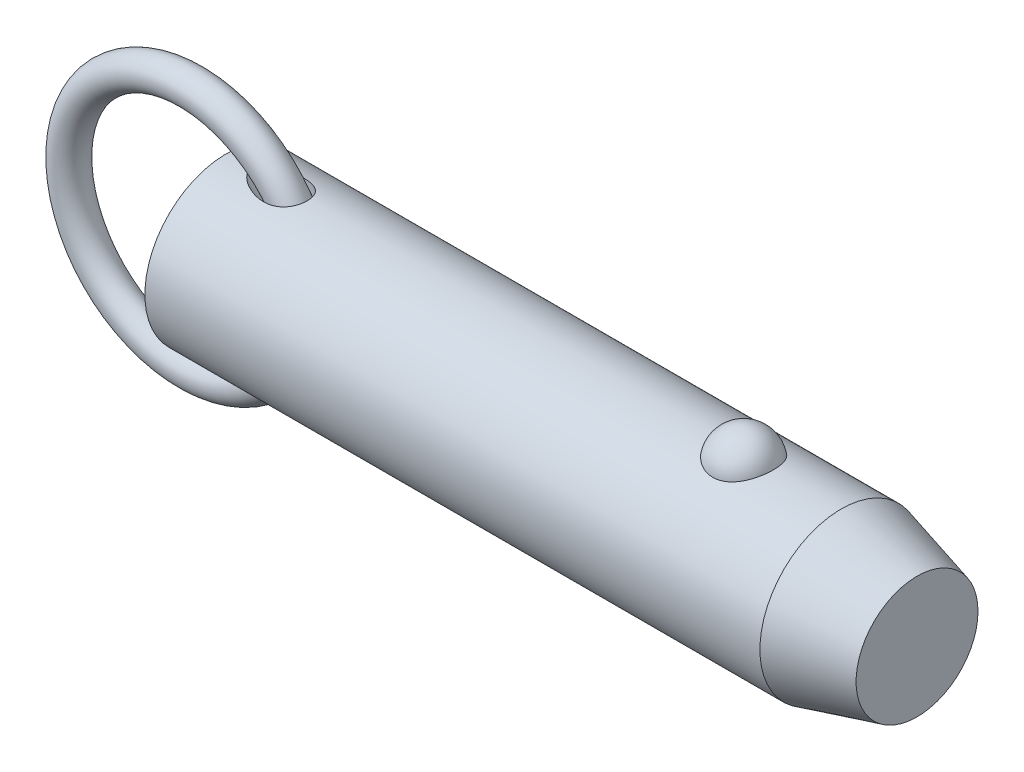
ISO-10303-21;
HEADER;
FILE_DESCRIPTION(('STEP AP214'),'2;1');
FILE_NAME('part.step','',(''),(''),'','','');
FILE_SCHEMA(('AUTOMOTIVE_DESIGN { 1 0 10303 214 1 1 1 1 }'));
ENDSEC;
DATA;
#1=APPLICATION_CONTEXT('core data for automotive mechanical design processes');
#2=APPLICATION_PROTOCOL_DEFINITION('international standard','automotive_design',2000,#1);
#3=PRODUCT_CONTEXT('',#1,'mechanical');
#4=PRODUCT('Part','Part','',(#3));
#5=PRODUCT_RELATED_PRODUCT_CATEGORY('part','',(#4));
#6=PRODUCT_DEFINITION_FORMATION('','',#4);
#7=PRODUCT_DEFINITION_CONTEXT('part definition',#1,'design');
#8=PRODUCT_DEFINITION('design','',#6,#7);
#9=PRODUCT_DEFINITION_SHAPE('','',#8);
#10=(LENGTH_UNIT() NAMED_UNIT(*) SI_UNIT(.MILLI.,.METRE.));
#11=(NAMED_UNIT(*) PLANE_ANGLE_UNIT() SI_UNIT($,.RADIAN.));
#12=(NAMED_UNIT(*) SI_UNIT($,.STERADIAN.) SOLID_ANGLE_UNIT());
#13=UNCERTAINTY_MEASURE_WITH_UNIT(LENGTH_MEASURE(1.E-05),#10,'distance_accuracy_value','');
#14=(GEOMETRIC_REPRESENTATION_CONTEXT(3) GLOBAL_UNCERTAINTY_ASSIGNED_CONTEXT((#13)) GLOBAL_UNIT_ASSIGNED_CONTEXT((#10,
#11,#12)) REPRESENTATION_CONTEXT('',''));
#15=CARTESIAN_POINT('',(0.,0.,0.));
#16=DIRECTION('',(0.,0.,1.));
#17=DIRECTION('',(1.,0.,0.));
#18=AXIS2_PLACEMENT_3D('',#15,#16,#17);
#19=CARTESIAN_POINT('',(-5.53898640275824,0.,0.));
#20=DIRECTION('',(0.,0.,1.));
#21=DIRECTION('',(1.,0.,0.));
#22=AXIS2_PLACEMENT_3D('',#19,#20,#21);
#23=TOROIDAL_SURFACE('',#22,19.05,2.54);
#24=CARTESIAN_POINT('',(16.0510135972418,0.,0.));
#25=VERTEX_POINT('',#24);
#26=VERTEX_LOOP('',#25);
#27=FACE_BOUND('',#26,.T.);
#28=ADVANCED_FACE('P0_F12',(#27),#23,.T.);
#29=CLOSED_SHELL('',(#28));
#30=MANIFOLD_SOLID_BREP('P0_B1',#29);
#31=CARTESIAN_POINT('',(0.,0.,0.));
#32=DIRECTION('',(1.,0.,0.));
#33=DIRECTION('',(0.,0.,-1.));
#34=AXIS2_PLACEMENT_3D('',#31,#32,#33);
#35=CYLINDRICAL_SURFACE('',#34,12.7);
#36=CARTESIAN_POINT('',(96.1007386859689,0.,0.));
#37=DIRECTION('',(1.,0.,0.));
#38=DIRECTION('',(0.,0.,-1.));
#39=AXIS2_PLACEMENT_3D('',#36,#37,#38);
#40=CIRCLE('',#39,12.7);
#41=CARTESIAN_POINT('',(96.1007386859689,0.,-12.7));
#42=VERTEX_POINT('',#41);
#43=EDGE_CURVE('P1_E89',#42,#42,#40,.T.);
#44=ORIENTED_EDGE('',*,*,#43,.F.);
#45=EDGE_LOOP('',(#44));
#46=FACE_BOUND('',#45,.T.);
#47=CARTESIAN_POINT('',(0.,0.,0.));
#48=DIRECTION('',(1.,0.,0.));
#49=DIRECTION('',(0.,0.,-1.));
#50=AXIS2_PLACEMENT_3D('',#47,#48,#49);
#51=CIRCLE('',#50,12.7);
#52=CARTESIAN_POINT('',(0.,0.,-12.7));
#53=VERTEX_POINT('',#52);
#54=EDGE_CURVE('P1_E52',#53,#53,#51,.T.);
#55=ORIENTED_EDGE('',*,*,#54,.T.);
#56=EDGE_LOOP('',(#55));
#57=FACE_BOUND('',#56,.T.);
#58=CARTESIAN_POINT('',(80.8600429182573,11.7500437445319,4.81938502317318));
#59=CARTESIAN_POINT('',(80.735088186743,11.7500430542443,4.81938571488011));
#60=CARTESIAN_POINT('',(80.610144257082,11.7520975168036,4.81438658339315));
#61=CARTESIAN_POINT('',(80.3611425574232,11.760253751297,4.79442904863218));
#62=CARTESIAN_POINT('',(80.2370850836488,11.7663568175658,4.77946746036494));
#63=CARTESIAN_POINT('',(79.9909016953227,11.7824262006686,4.7397141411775));
#64=CARTESIAN_POINT('',(79.8687744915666,11.7923898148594,4.71492928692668));
#65=CARTESIAN_POINT('',(79.6271874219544,11.8158938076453,4.65571340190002));
#66=CARTESIAN_POINT('',(79.5077285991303,11.8294355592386,4.6212786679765));
#67=CARTESIAN_POINT('',(79.2725578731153,11.8596812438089,4.54309502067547));
#68=CARTESIAN_POINT('',(79.1568393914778,11.8763792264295,4.49936361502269));
#69=CARTESIAN_POINT('',(78.9296530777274,11.9124878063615,4.40287235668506));
#70=CARTESIAN_POINT('',(78.8181868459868,11.9318994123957,4.35010914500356));
#71=CARTESIAN_POINT('',(78.4912782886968,11.9934256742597,4.17881316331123));
#72=CARTESIAN_POINT('',(78.2831270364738,12.038858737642,4.04720756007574));
#73=CARTESIAN_POINT('',(77.8858509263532,12.1352173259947,3.748564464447));
#74=CARTESIAN_POINT('',(77.6974438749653,12.1862630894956,3.58061821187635));
#75=CARTESIAN_POINT('',(77.3505213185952,12.2875163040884,3.21600758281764));
#76=CARTESIAN_POINT('',(77.1920113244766,12.3377235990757,3.0193379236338));
#77=CARTESIAN_POINT('',(76.9016887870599,12.434492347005,2.592916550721));
#78=CARTESIAN_POINT('',(76.7713762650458,12.4807925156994,2.36208286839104));
#79=CARTESIAN_POINT('',(76.5494079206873,12.5623454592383,1.88070399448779));
#80=CARTESIAN_POINT('',(76.4577554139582,12.5975972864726,1.63015711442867));
#81=CARTESIAN_POINT('',(76.3140466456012,12.6538414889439,1.1129886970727));
#82=CARTESIAN_POINT('',(76.2624990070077,12.6746503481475,0.846205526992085));
#83=CARTESIAN_POINT('',(76.2019771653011,12.699153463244,0.307085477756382));
#84=CARTESIAN_POINT('',(76.1930018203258,12.7028481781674,0.0347487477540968));
#85=CARTESIAN_POINT('',(76.2177310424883,12.6927785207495,-0.506073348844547));
#86=CARTESIAN_POINT('',(76.2511899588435,12.6791146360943,-0.774571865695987));
#87=CARTESIAN_POINT('',(76.3596877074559,12.635882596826,-1.30170246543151));
#88=CARTESIAN_POINT('',(76.4347272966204,12.606314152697,-1.5603343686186));
#89=CARTESIAN_POINT('',(76.6250000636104,12.5342328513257,-2.06083899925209));
#90=CARTESIAN_POINT('',(76.7402872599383,12.4917026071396,-2.3026886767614));
#91=CARTESIAN_POINT('',(77.0087044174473,12.3981123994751,-2.76259600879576));
#92=CARTESIAN_POINT('',(77.1618374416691,12.3470517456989,-2.98065173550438));
#93=CARTESIAN_POINT('',(77.5035077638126,12.2416045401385,-3.38786328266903));
#94=CARTESIAN_POINT('',(77.6922017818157,12.1872040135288,-3.57688418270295));
#95=CARTESIAN_POINT('',(78.1002392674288,12.0814086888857,-3.91941073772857));
#96=CARTESIAN_POINT('',(78.3195800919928,12.0300136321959,-4.07291945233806));
#97=CARTESIAN_POINT('',(78.778375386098,11.9373542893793,-4.33691289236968));
#98=CARTESIAN_POINT('',(79.0173044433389,11.8958982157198,-4.44824125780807));
#99=CARTESIAN_POINT('',(79.5124376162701,11.8268116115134,-4.62881985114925));
#100=CARTESIAN_POINT('',(79.7686351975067,11.7991758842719,-4.69808589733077));
#101=CARTESIAN_POINT('',(80.2771640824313,11.7622209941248,-4.78983181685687));
#102=CARTESIAN_POINT('',(80.5290414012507,11.7520502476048,-4.81449025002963));
#103=CARTESIAN_POINT('',(81.0335734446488,11.7485796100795,-4.82295735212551));
#104=CARTESIAN_POINT('',(81.2862280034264,11.7552763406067,-4.80677420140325));
#105=CARTESIAN_POINT('',(81.7768341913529,11.7842584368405,-4.73525430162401));
#106=CARTESIAN_POINT('',(82.0149984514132,11.8060486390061,-4.68116061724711));
#107=CARTESIAN_POINT('',(82.4784894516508,11.8622750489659,-4.53678133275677));
#108=CARTESIAN_POINT('',(82.7038151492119,11.8967122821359,-4.44649279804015));
#109=CARTESIAN_POINT('',(83.1408018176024,11.9754603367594,-4.2298761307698));
#110=CARTESIAN_POINT('',(83.3520579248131,12.0199699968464,-4.10280539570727));
#111=CARTESIAN_POINT('',(83.7506012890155,12.1138028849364,-3.81685409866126));
#112=CARTESIAN_POINT('',(83.9378830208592,12.163127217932,-3.65796622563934));
#113=CARTESIAN_POINT('',(84.2933509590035,12.2642343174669,-3.30364864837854));
#114=CARTESIAN_POINT('',(84.4601119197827,12.3160165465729,-3.10678783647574));
#115=CARTESIAN_POINT('',(84.7595799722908,12.4142566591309,-2.68748409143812));
#116=CARTESIAN_POINT('',(84.8922809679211,12.4607135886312,-2.46503658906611));
#117=CARTESIAN_POINT('',(85.1246912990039,12.5450236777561,-1.99289519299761));
#118=CARTESIAN_POINT('',(85.223215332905,12.5825557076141,-1.7425591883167));
#119=CARTESIAN_POINT('',(85.3792277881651,12.6431720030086,-1.22773734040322));
#120=CARTESIAN_POINT('',(85.4367157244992,12.6662560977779,-0.963251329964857));
#121=CARTESIAN_POINT('',(85.5095441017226,12.6956486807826,-0.427355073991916));
#122=CARTESIAN_POINT('',(85.5248378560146,12.7019385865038,-0.155937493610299));
#123=CARTESIAN_POINT('',(85.5127794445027,12.6970201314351,0.385928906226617));
#124=CARTESIAN_POINT('',(85.4854280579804,12.6858120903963,0.656377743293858));
#125=CARTESIAN_POINT('',(85.4130609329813,12.6568455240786,1.05454017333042));
#126=CARTESIAN_POINT('',(85.3837963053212,12.6451962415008,1.18577850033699));
#127=CARTESIAN_POINT('',(85.3150228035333,12.6181819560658,1.4451380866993));
#128=CARTESIAN_POINT('',(85.2755176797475,12.6028183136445,1.57326046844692));
#129=CARTESIAN_POINT('',(85.1864397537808,12.5687547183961,1.82554978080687));
#130=CARTESIAN_POINT('',(85.1368627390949,12.5500533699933,1.9497150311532));
#131=CARTESIAN_POINT('',(85.0279211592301,12.5098093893,2.19314370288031));
#132=CARTESIAN_POINT('',(84.9685601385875,12.4882677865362,2.31240887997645));
#133=CARTESIAN_POINT('',(84.8399712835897,12.4427679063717,2.54593031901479));
#134=CARTESIAN_POINT('',(84.7706888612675,12.4187964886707,2.66015396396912));
#135=CARTESIAN_POINT('',(84.622903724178,12.3691892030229,2.88202659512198));
#136=CARTESIAN_POINT('',(84.5444044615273,12.3435539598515,2.98967802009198));
#137=CARTESIAN_POINT('',(84.3785502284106,12.2912955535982,3.19774385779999));
#138=CARTESIAN_POINT('',(84.2911918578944,12.2646720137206,3.29815546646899));
#139=CARTESIAN_POINT('',(84.1081617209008,12.2111945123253,3.49095035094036));
#140=CARTESIAN_POINT('',(84.0124932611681,12.1843406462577,3.58333679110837));
#141=CARTESIAN_POINT('',(83.8136272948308,12.1312249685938,3.75922876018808));
#142=CARTESIAN_POINT('',(83.7104503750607,12.104961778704,3.84275713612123));
#143=CARTESIAN_POINT('',(83.4970133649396,12.0537284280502,4.00056406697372));
#144=CARTESIAN_POINT('',(83.3867562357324,12.028757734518,4.07484645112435));
#145=CARTESIAN_POINT('',(83.1597550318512,11.9808306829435,4.21367959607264));
#146=CARTESIAN_POINT('',(83.0430068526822,11.9578756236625,4.27822410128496));
#147=CARTESIAN_POINT('',(82.8039425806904,11.9147184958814,4.39698483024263));
#148=CARTESIAN_POINT('',(82.6816287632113,11.894515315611,4.45120522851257));
#149=CARTESIAN_POINT('',(82.422952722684,11.8561129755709,4.55255353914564));
#150=CARTESIAN_POINT('',(82.2862237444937,11.8381764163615,4.59884858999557));
#151=CARTESIAN_POINT('',(82.0086087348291,11.8069093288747,4.67853897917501));
#152=CARTESIAN_POINT('',(81.8677245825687,11.7935767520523,4.71194005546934));
#153=CARTESIAN_POINT('',(81.5830944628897,11.7720277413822,4.76552188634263));
#154=CARTESIAN_POINT('',(81.4393488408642,11.7638106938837,4.78570422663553));
#155=CARTESIAN_POINT('',(81.1504114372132,11.7528195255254,4.81263433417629));
#156=CARTESIAN_POINT('',(81.0052198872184,11.7500445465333,4.81938421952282));
#157=CARTESIAN_POINT('',(80.8600429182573,11.7500437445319,4.81938502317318));
#158=B_SPLINE_CURVE_WITH_KNOTS('',3,(#58,#59,#60,#61,#62,#63,#64,#65,#66,#67,#68,#69,#70,#71,
#72,#73,#74,#75,#76,#77,#78,#79,#80,#81,#82,#83,#84,#85,#86,#87,#88,#89,#90,#91,#92,#93,#94,#95,
#96,#97,#98,#99,#100,#101,#102,#103,#104,#105,#106,#107,#108,#109,#110,#111,#112,#113,#114,#115,
#116,#117,#118,#119,#120,#121,#122,#123,#124,#125,#126,#127,#128,#129,#130,#131,#132,#133,#134,
#135,#136,#137,#138,#139,#140,#141,#142,#143,#144,#145,#146,#147,#148,#149,#150,#151,#152,#153,
#154,#155,#156,#157),.UNSPECIFIED.,.T.,.F.,(4,2,2,2,2,2,2,2,2,2,2,2,2,2,2,2,2,2,2,2,2,2,2,2,2,2,
2,2,2,2,2,2,2,2,2,2,2,2,2,2,2,2,2,2,2,2,2,2,2,4),(0.,0.374729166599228,0.749578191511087,
1.12416526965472,1.49889629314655,1.87292776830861,2.24709865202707,2.99481328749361,
3.76399449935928,4.53331735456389,5.33683915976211,6.14042986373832,6.95405296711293,
7.76765424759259,8.57656703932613,9.38549455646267,10.1955119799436,11.0055949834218,
11.8193353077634,12.6330054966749,13.4294141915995,14.2255231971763,14.9815786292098,
15.7374826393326,16.4696948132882,17.2019663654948,17.9501979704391,18.6986017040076,
19.4844704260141,20.2704797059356,21.0815215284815,21.8925729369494,22.7045213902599,
23.5164550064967,23.9209608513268,24.3253187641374,24.7298461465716,25.1342272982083,
25.54092555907,25.9474719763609,26.3541750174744,26.7607169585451,27.1661834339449,
27.5714814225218,27.9770386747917,28.3824315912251,28.8181206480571,29.2536155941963,
29.6890582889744,30.1244323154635),.UNSPECIFIED.);
#159=CARTESIAN_POINT('',(80.8600429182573,11.7500437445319,4.81938502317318));
#160=VERTEX_POINT('',#159);
#161=EDGE_CURVE('P1_E80',#160,#160,#158,.T.);
#162=ORIENTED_EDGE('',*,*,#161,.T.);
#163=EDGE_LOOP('',(#162));
#164=FACE_BOUND('',#163,.T.);
#165=CARTESIAN_POINT('',(-5.53898640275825,0.,0.));
#166=DIRECTION('',(0.796400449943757,-0.604769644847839,0.));
#167=DIRECTION('',(0.604769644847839,0.796400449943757,0.));
#168=AXIS2_PLACEMENT_3D('',#165,#166,#167);
#169=ELLIPSE('',#168,15.9467514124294,12.7);
#170=CARTESIAN_POINT('',(4.09482149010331,12.6864319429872,0.5868939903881));
#171=VERTEX_POINT('',#170);
#172=CARTESIAN_POINT('',(4.09482149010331,12.6864319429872,-0.5868939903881));
#173=VERTEX_POINT('',#172);
#174=EDGE_CURVE('P1_E47',#171,#173,#169,.F.);
#175=ORIENTED_EDGE('',*,*,#174,.T.);
#176=CARTESIAN_POINT('',(4.06153170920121,12.6905758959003,-0.489166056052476));
#177=CARTESIAN_POINT('',(4.08111374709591,12.6881366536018,-0.552489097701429));
#178=CARTESIAN_POINT('',(4.10417851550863,12.6852663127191,-0.614604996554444));
#179=CARTESIAN_POINT('',(4.15628434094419,12.6787965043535,-0.736067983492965));
#180=CARTESIAN_POINT('',(4.18531032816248,12.6751988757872,-0.795421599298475));
#181=CARTESIAN_POINT('',(4.27911159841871,12.6636052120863,-0.967590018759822));
#182=CARTESIAN_POINT('',(4.35123408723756,12.654730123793,-1.07635920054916));
#183=CARTESIAN_POINT('',(4.49106800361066,12.6376715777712,-1.25922957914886));
#184=CARTESIAN_POINT('',(4.55601066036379,12.6297947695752,-1.33556751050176));
#185=CARTESIAN_POINT('',(4.69223626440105,12.6134116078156,-1.48232741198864));
#186=CARTESIAN_POINT('',(4.76352147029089,12.6049050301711,-1.55274725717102));
#187=CARTESIAN_POINT('',(4.91163946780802,12.587417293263,-1.68868704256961));
#188=CARTESIAN_POINT('',(4.98851399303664,12.5784327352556,-1.75416062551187));
#189=CARTESIAN_POINT('',(5.14630057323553,12.560235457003,-1.88003275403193));
#190=CARTESIAN_POINT('',(5.22721398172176,12.5510226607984,-1.94042957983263));
#191=CARTESIAN_POINT('',(5.45368877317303,12.5256514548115,-2.09966332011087));
#192=CARTESIAN_POINT('',(5.60261616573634,12.5094182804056,-2.19371988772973));
#193=CARTESIAN_POINT('',(5.90795545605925,12.4774211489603,-2.36893890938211));
#194=CARTESIAN_POINT('',(6.064372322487,12.4616575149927,-2.45009264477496));
#195=CARTESIAN_POINT('',(6.3830613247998,12.431227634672,-2.60008249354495));
#196=CARTESIAN_POINT('',(6.54533237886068,12.4165611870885,-2.66892086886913));
#197=CARTESIAN_POINT('',(6.87462618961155,12.3889351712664,-2.79435199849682));
#198=CARTESIAN_POINT('',(7.04164773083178,12.3759751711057,-2.8509478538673));
#199=CARTESIAN_POINT('',(7.38726647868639,12.3518460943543,-2.95377962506));
#200=CARTESIAN_POINT('',(7.56604577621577,12.3407843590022,-2.99943209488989));
#201=CARTESIAN_POINT('',(7.92698692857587,12.3219309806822,-3.07596683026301));
#202=CARTESIAN_POINT('',(8.10914972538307,12.314140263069,-3.10684491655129));
#203=CARTESIAN_POINT('',(8.475114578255,12.3025918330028,-3.152268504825));
#204=CARTESIAN_POINT('',(8.65890979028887,12.2988216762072,-3.16686440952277));
#205=CARTESIAN_POINT('',(9.0269608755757,12.2959421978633,-3.17802250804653));
#206=CARTESIAN_POINT('',(9.21121628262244,12.2968292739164,-3.17459864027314));
#207=CARTESIAN_POINT('',(9.61636263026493,12.3045198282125,-3.14471110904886));
#208=CARTESIAN_POINT('',(9.83695552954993,12.3125080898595,-3.1136323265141));
#209=CARTESIAN_POINT('',(10.1619126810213,12.3303028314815,-3.04206574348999));
#210=CARTESIAN_POINT('',(10.2692747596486,12.3372061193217,-3.01403983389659));
#211=CARTESIAN_POINT('',(10.4811758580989,12.3528538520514,-2.94925947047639));
#212=CARTESIAN_POINT('',(10.5857162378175,12.361597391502,-2.91250930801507));
#213=CARTESIAN_POINT('',(10.7921321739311,12.3808585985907,-2.82951748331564));
#214=CARTESIAN_POINT('',(10.8939665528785,12.3913944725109,-2.78317723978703));
#215=CARTESIAN_POINT('',(11.0926118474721,12.4138762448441,-2.68112002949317));
#216=CARTESIAN_POINT('',(11.1894254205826,12.4258213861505,-2.6254080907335));
#217=CARTESIAN_POINT('',(11.3768740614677,12.4507225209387,-2.5046565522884));
#218=CARTESIAN_POINT('',(11.46751150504,12.4636781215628,-2.43962056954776));
#219=CARTESIAN_POINT('',(11.6414572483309,12.4901070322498,-2.30048560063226));
#220=CARTESIAN_POINT('',(11.7247669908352,12.5035802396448,-2.22638840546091));
#221=CARTESIAN_POINT('',(11.8713131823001,12.5285000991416,-2.08117367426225));
#222=CARTESIAN_POINT('',(11.9357009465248,12.5399538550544,-2.01121596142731));
#223=CARTESIAN_POINT('',(12.0576805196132,12.5624496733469,-1.86555293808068));
#224=CARTESIAN_POINT('',(12.1152732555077,12.5734917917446,-1.78984841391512));
#225=CARTESIAN_POINT('',(12.223073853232,12.5947858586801,-1.63327883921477));
#226=CARTESIAN_POINT('',(12.2732844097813,12.6050380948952,-1.55241568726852));
#227=CARTESIAN_POINT('',(12.3658430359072,12.6243983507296,-1.3862126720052));
#228=CARTESIAN_POINT('',(12.4081916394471,12.6335064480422,-1.30087311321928));
#229=CARTESIAN_POINT('',(12.5150098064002,12.6569076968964,-1.05702619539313));
#230=CARTESIAN_POINT('',(12.5703399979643,12.6695746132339,-0.894232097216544));
#231=CARTESIAN_POINT('',(12.6526225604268,12.6886816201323,-0.561391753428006));
#232=CARTESIAN_POINT('',(12.6795825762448,12.6951233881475,-0.391347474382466));
#233=CARTESIAN_POINT('',(12.7041016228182,12.7009766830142,-0.0537636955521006));
#234=CARTESIAN_POINT('',(12.7024538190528,12.7005778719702,0.113714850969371));
#235=CARTESIAN_POINT('',(12.6717240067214,12.6932548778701,0.445979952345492));
#236=CARTESIAN_POINT('',(12.6426435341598,12.6863310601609,0.610766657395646));
#237=CARTESIAN_POINT('',(12.5579769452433,12.6667465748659,0.932429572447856));
#238=CARTESIAN_POINT('',(12.5024793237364,12.6541050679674,1.08933027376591));
#239=CARTESIAN_POINT('',(12.3665691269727,12.6244558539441,1.39146752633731));
#240=CARTESIAN_POINT('',(12.2861577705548,12.6074483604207,1.536704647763));
#241=CARTESIAN_POINT('',(12.1018203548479,12.5706804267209,1.81319588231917));
#242=CARTESIAN_POINT('',(11.9976588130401,12.5508932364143,1.94428915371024));
#243=CARTESIAN_POINT('',(11.7695265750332,12.5107540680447,2.18776051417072));
#244=CARTESIAN_POINT('',(11.6455540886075,12.4904020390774,2.30013691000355));
#245=CARTESIAN_POINT('',(11.3759347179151,12.4502278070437,2.50870972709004));
#246=CARTESIAN_POINT('',(11.2295880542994,12.4304654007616,2.60400962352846));
#247=CARTESIAN_POINT('',(10.9239803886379,12.3941696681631,2.7716292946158));
#248=CARTESIAN_POINT('',(10.7647152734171,12.3776373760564,2.84394171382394));
#249=CARTESIAN_POINT('',(10.4192039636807,12.3473062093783,2.9730352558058));
#250=CARTESIAN_POINT('',(10.231933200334,12.3340204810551,3.02717164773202));
#251=CARTESIAN_POINT('',(9.85152982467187,12.3134301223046,3.10986173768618));
#252=CARTESIAN_POINT('',(9.65839336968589,12.3061295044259,3.13839827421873));
#253=CARTESIAN_POINT('',(9.31022514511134,12.2982822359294,3.16897517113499));
#254=CARTESIAN_POINT('',(9.15555718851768,12.2966525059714,3.17526894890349));
#255=CARTESIAN_POINT('',(8.8461894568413,12.2967963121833,3.17471335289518));
#256=CARTESIAN_POINT('',(8.69148970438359,12.2985715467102,3.16785742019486));
#257=CARTESIAN_POINT('',(8.38280471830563,12.3051648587,3.14214692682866));
#258=CARTESIAN_POINT('',(8.22882218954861,12.3099904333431,3.12326280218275));
#259=CARTESIAN_POINT('',(7.92276070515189,12.3222644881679,3.07448013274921));
#260=CARTESIAN_POINT('',(7.77068148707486,12.3297126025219,3.04458312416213));
#261=CARTESIAN_POINT('',(7.46452663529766,12.3470493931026,2.97350781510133));
#262=CARTESIAN_POINT('',(7.31052714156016,12.3570043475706,2.93201910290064));
#263=CARTESIAN_POINT('',(7.00579083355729,12.3787609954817,2.83876185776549));
#264=CARTESIAN_POINT('',(6.85505451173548,12.3905629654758,2.78699178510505));
#265=CARTESIAN_POINT('',(6.55781208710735,12.415528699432,2.67357744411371));
#266=CARTESIAN_POINT('',(6.4112978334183,12.4286895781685,2.61195394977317));
#267=CARTESIAN_POINT('',(6.12302950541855,12.4559398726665,2.47874512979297));
#268=CARTESIAN_POINT('',(5.98127390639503,12.4700289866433,2.40716303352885));
#269=CARTESIAN_POINT('',(5.67073126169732,12.5020754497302,2.23550426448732));
#270=CARTESIAN_POINT('',(5.50343839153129,12.5201625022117,2.13268685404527));
#271=CARTESIAN_POINT('',(5.2614761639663,12.5471537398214,1.96522579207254));
#272=CARTESIAN_POINT('',(5.18224299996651,12.5561365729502,1.90713440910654));
#273=CARTESIAN_POINT('',(5.02746475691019,12.573912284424,1.78618989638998));
#274=CARTESIAN_POINT('',(4.95191912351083,12.5827051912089,1.72333748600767));
#275=CARTESIAN_POINT('',(4.81787163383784,12.598469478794,1.60360864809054));
#276=CARTESIAN_POINT('',(4.75865966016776,12.6054958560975,1.54753994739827));
#277=CARTESIAN_POINT('',(4.64406285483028,12.6191906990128,1.43158546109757));
#278=CARTESIAN_POINT('',(4.58867926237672,12.6258590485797,1.37169845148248));
#279=CARTESIAN_POINT('',(4.43014912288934,12.6450546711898,1.1865667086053));
#280=CARTESIAN_POINT('',(4.33372726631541,12.6568788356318,1.05507993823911));
#281=CARTESIAN_POINT('',(4.21252055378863,12.6718304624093,0.848052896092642));
#282=CARTESIAN_POINT('',(4.17660155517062,12.6762773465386,0.779100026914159));
#283=CARTESIAN_POINT('',(4.11264979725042,12.6842122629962,0.637080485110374));
#284=CARTESIAN_POINT('',(4.08466792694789,12.6876941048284,0.563990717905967));
#285=CARTESIAN_POINT('',(4.06153170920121,12.6905758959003,0.489166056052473));
#286=B_SPLINE_CURVE_WITH_KNOTS('',3,(#176,#177,#178,#179,#180,#181,#182,#183,#184,#185,#186,
#187,#188,#189,#190,#191,#192,#193,#194,#195,#196,#197,#198,#199,#200,#201,#202,#203,#204,#205,
#206,#207,#208,#209,#210,#211,#212,#213,#214,#215,#216,#217,#218,#219,#220,#221,#222,#223,#224,
#225,#226,#227,#228,#229,#230,#231,#232,#233,#234,#235,#236,#237,#238,#239,#240,#241,#242,#243,
#244,#245,#246,#247,#248,#249,#250,#251,#252,#253,#254,#255,#256,#257,#258,#259,#260,#261,#262,
#263,#264,#265,#266,#267,#268,#269,#270,#271,#272,#273,#274,#275,#276,#277,#278,#279,#280,#281,
#282,#283,#284,#285),.UNSPECIFIED.,.F.,.F.,(4,2,2,2,2,2,2,2,2,2,2,2,2,2,2,2,2,2,2,2,2,2,2,2,2,2,
2,2,2,2,2,2,2,2,2,2,2,2,2,2,2,2,2,2,2,2,2,2,2,2,2,2,2,2,4),(0.,0.198708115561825,
0.396919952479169,0.787580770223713,1.08882492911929,1.39017679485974,1.69407136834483,
1.99806847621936,2.52793143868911,3.0581509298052,3.588272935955,4.11826050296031,
4.67218806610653,5.22627222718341,5.77863637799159,6.33057333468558,6.99657211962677,
7.3297741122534,7.662812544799,7.99946156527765,8.33593054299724,8.67226935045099,
9.0085417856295,9.29544181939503,9.58230266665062,9.86905853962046,10.1557949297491,
10.6702338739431,11.1845341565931,11.6845985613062,12.1846349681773,12.6830079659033,
13.1813565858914,13.68487951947,14.1884479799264,14.713533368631,15.2387866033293,
15.8228373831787,16.407279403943,16.8710810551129,17.3351141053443,17.8002921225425,
18.2654052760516,18.7444169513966,19.2235004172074,19.7015868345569,20.1795185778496,
20.7699825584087,21.0658110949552,21.3615950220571,21.606957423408,21.8523988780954,
22.3397467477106,22.5729183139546,22.8075527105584),.UNSPECIFIED.);
#287=EDGE_CURVE('P1_E51',#173,#171,#286,.T.);
#288=ORIENTED_EDGE('',*,*,#287,.T.);
#289=EDGE_LOOP('',(#175,#288));
#290=FACE_BOUND('',#289,.T.);
#291=CARTESIAN_POINT('',(-5.53898640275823,0.,0.));
#292=DIRECTION('',(-0.796400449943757,-0.604769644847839,0.));
#293=DIRECTION('',(0.604769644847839,-0.796400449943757,0.));
#294=AXIS2_PLACEMENT_3D('',#291,#292,#293);
#295=ELLIPSE('',#294,15.9467514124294,12.7);
#296=CARTESIAN_POINT('',(4.09482149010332,-12.6864319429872,0.58689399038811));
#297=VERTEX_POINT('',#296);
#298=CARTESIAN_POINT('',(4.09482149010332,-12.6864319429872,-0.58689399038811));
#299=VERTEX_POINT('',#298);
#300=EDGE_CURVE('P1_E28',#297,#299,#295,.F.);
#301=ORIENTED_EDGE('',*,*,#300,.F.);
#302=CARTESIAN_POINT('',(4.06153170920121,-12.6905758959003,0.489166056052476));
#303=CARTESIAN_POINT('',(4.08111374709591,-12.6881366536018,0.552489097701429));
#304=CARTESIAN_POINT('',(4.10417851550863,-12.6852663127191,0.614604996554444));
#305=CARTESIAN_POINT('',(4.15628434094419,-12.6787965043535,0.736067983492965));
#306=CARTESIAN_POINT('',(4.18531032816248,-12.6751988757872,0.795421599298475));
#307=CARTESIAN_POINT('',(4.27911159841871,-12.6636052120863,0.967590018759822));
#308=CARTESIAN_POINT('',(4.35123408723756,-12.654730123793,1.07635920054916));
#309=CARTESIAN_POINT('',(4.49106800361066,-12.6376715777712,1.25922957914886));
#310=CARTESIAN_POINT('',(4.55601066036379,-12.6297947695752,1.33556751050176));
#311=CARTESIAN_POINT('',(4.69223626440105,-12.6134116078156,1.48232741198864));
#312=CARTESIAN_POINT('',(4.76352147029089,-12.6049050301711,1.55274725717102));
#313=CARTESIAN_POINT('',(4.91163946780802,-12.587417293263,1.68868704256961));
#314=CARTESIAN_POINT('',(4.98851399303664,-12.5784327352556,1.75416062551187));
#315=CARTESIAN_POINT('',(5.14630057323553,-12.560235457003,1.88003275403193));
#316=CARTESIAN_POINT('',(5.22721398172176,-12.5510226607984,1.94042957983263));
#317=CARTESIAN_POINT('',(5.45368877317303,-12.5256514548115,2.09966332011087));
#318=CARTESIAN_POINT('',(5.60261616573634,-12.5094182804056,2.19371988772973));
#319=CARTESIAN_POINT('',(5.90795545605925,-12.4774211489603,2.36893890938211));
#320=CARTESIAN_POINT('',(6.064372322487,-12.4616575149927,2.45009264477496));
#321=CARTESIAN_POINT('',(6.3830613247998,-12.431227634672,2.60008249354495));
#322=CARTESIAN_POINT('',(6.54533237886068,-12.4165611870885,2.66892086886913));
#323=CARTESIAN_POINT('',(6.87462618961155,-12.3889351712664,2.79435199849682));
#324=CARTESIAN_POINT('',(7.04164773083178,-12.3759751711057,2.8509478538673));
#325=CARTESIAN_POINT('',(7.38726647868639,-12.3518460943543,2.95377962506));
#326=CARTESIAN_POINT('',(7.56604577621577,-12.3407843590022,2.99943209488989));
#327=CARTESIAN_POINT('',(7.92698692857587,-12.3219309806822,3.07596683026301));
#328=CARTESIAN_POINT('',(8.10914972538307,-12.314140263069,3.10684491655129));
#329=CARTESIAN_POINT('',(8.475114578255,-12.3025918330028,3.152268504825));
#330=CARTESIAN_POINT('',(8.65890979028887,-12.2988216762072,3.16686440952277));
#331=CARTESIAN_POINT('',(9.0269608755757,-12.2959421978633,3.17802250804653));
#332=CARTESIAN_POINT('',(9.21121628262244,-12.2968292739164,3.17459864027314));
#333=CARTESIAN_POINT('',(9.61636263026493,-12.3045198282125,3.14471110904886));
#334=CARTESIAN_POINT('',(9.83695552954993,-12.3125080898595,3.1136323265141));
#335=CARTESIAN_POINT('',(10.1619126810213,-12.3303028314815,3.04206574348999));
#336=CARTESIAN_POINT('',(10.2692747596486,-12.3372061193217,3.01403983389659));
#337=CARTESIAN_POINT('',(10.4811758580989,-12.3528538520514,2.94925947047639));
#338=CARTESIAN_POINT('',(10.5857162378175,-12.361597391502,2.91250930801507));
#339=CARTESIAN_POINT('',(10.7921321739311,-12.3808585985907,2.82951748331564));
#340=CARTESIAN_POINT('',(10.8939665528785,-12.3913944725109,2.78317723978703));
#341=CARTESIAN_POINT('',(11.0926118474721,-12.4138762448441,2.68112002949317));
#342=CARTESIAN_POINT('',(11.1894254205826,-12.4258213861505,2.6254080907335));
#343=CARTESIAN_POINT('',(11.3768740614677,-12.4507225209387,2.5046565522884));
#344=CARTESIAN_POINT('',(11.46751150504,-12.4636781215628,2.43962056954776));
#345=CARTESIAN_POINT('',(11.6414572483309,-12.4901070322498,2.30048560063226));
#346=CARTESIAN_POINT('',(11.7247669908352,-12.5035802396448,2.22638840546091));
#347=CARTESIAN_POINT('',(11.8713131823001,-12.5285000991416,2.08117367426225));
#348=CARTESIAN_POINT('',(11.9357009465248,-12.5399538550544,2.01121596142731));
#349=CARTESIAN_POINT('',(12.0576805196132,-12.5624496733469,1.86555293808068));
#350=CARTESIAN_POINT('',(12.1152732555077,-12.5734917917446,1.78984841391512));
#351=CARTESIAN_POINT('',(12.223073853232,-12.5947858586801,1.63327883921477));
#352=CARTESIAN_POINT('',(12.2732844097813,-12.6050380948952,1.55241568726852));
#353=CARTESIAN_POINT('',(12.3658430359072,-12.6243983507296,1.3862126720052));
#354=CARTESIAN_POINT('',(12.4081916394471,-12.6335064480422,1.30087311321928));
#355=CARTESIAN_POINT('',(12.5150098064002,-12.6569076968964,1.05702619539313));
#356=CARTESIAN_POINT('',(12.5703399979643,-12.6695746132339,0.894232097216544));
#357=CARTESIAN_POINT('',(12.6526225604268,-12.6886816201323,0.561391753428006));
#358=CARTESIAN_POINT('',(12.6795825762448,-12.6951233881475,0.391347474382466));
#359=CARTESIAN_POINT('',(12.7041016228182,-12.7009766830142,0.0537636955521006));
#360=CARTESIAN_POINT('',(12.7024538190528,-12.7005778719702,-0.113714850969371));
#361=CARTESIAN_POINT('',(12.6717240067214,-12.6932548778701,-0.445979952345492));
#362=CARTESIAN_POINT('',(12.6426435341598,-12.6863310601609,-0.610766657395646));
#363=CARTESIAN_POINT('',(12.5579769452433,-12.6667465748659,-0.932429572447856));
#364=CARTESIAN_POINT('',(12.5024793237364,-12.6541050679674,-1.08933027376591));
#365=CARTESIAN_POINT('',(12.3665691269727,-12.6244558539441,-1.39146752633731));
#366=CARTESIAN_POINT('',(12.2861577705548,-12.6074483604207,-1.536704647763));
#367=CARTESIAN_POINT('',(12.1018203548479,-12.5706804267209,-1.81319588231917));
#368=CARTESIAN_POINT('',(11.9976588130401,-12.5508932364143,-1.94428915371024));
#369=CARTESIAN_POINT('',(11.7695265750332,-12.5107540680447,-2.18776051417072));
#370=CARTESIAN_POINT('',(11.6455540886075,-12.4904020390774,-2.30013691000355));
#371=CARTESIAN_POINT('',(11.3759347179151,-12.4502278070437,-2.50870972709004));
#372=CARTESIAN_POINT('',(11.2295880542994,-12.4304654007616,-2.60400962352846));
#373=CARTESIAN_POINT('',(10.9239803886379,-12.3941696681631,-2.7716292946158));
#374=CARTESIAN_POINT('',(10.7647152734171,-12.3776373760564,-2.84394171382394));
#375=CARTESIAN_POINT('',(10.4192039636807,-12.3473062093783,-2.9730352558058));
#376=CARTESIAN_POINT('',(10.231933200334,-12.3340204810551,-3.02717164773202));
#377=CARTESIAN_POINT('',(9.85152982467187,-12.3134301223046,-3.10986173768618));
#378=CARTESIAN_POINT('',(9.65839336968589,-12.3061295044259,-3.13839827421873));
#379=CARTESIAN_POINT('',(9.31022514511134,-12.2982822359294,-3.16897517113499));
#380=CARTESIAN_POINT('',(9.15555718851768,-12.2966525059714,-3.17526894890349));
#381=CARTESIAN_POINT('',(8.8461894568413,-12.2967963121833,-3.17471335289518));
#382=CARTESIAN_POINT('',(8.69148970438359,-12.2985715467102,-3.16785742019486));
#383=CARTESIAN_POINT('',(8.38280471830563,-12.3051648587,-3.14214692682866));
#384=CARTESIAN_POINT('',(8.22882218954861,-12.3099904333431,-3.12326280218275));
#385=CARTESIAN_POINT('',(7.92276070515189,-12.3222644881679,-3.07448013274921));
#386=CARTESIAN_POINT('',(7.77068148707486,-12.3297126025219,-3.04458312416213));
#387=CARTESIAN_POINT('',(7.46452663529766,-12.3470493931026,-2.97350781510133));
#388=CARTESIAN_POINT('',(7.31052714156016,-12.3570043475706,-2.93201910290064));
#389=CARTESIAN_POINT('',(7.00579083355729,-12.3787609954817,-2.83876185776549));
#390=CARTESIAN_POINT('',(6.85505451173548,-12.3905629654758,-2.78699178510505));
#391=CARTESIAN_POINT('',(6.55781208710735,-12.415528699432,-2.67357744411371));
#392=CARTESIAN_POINT('',(6.4112978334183,-12.4286895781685,-2.61195394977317));
#393=CARTESIAN_POINT('',(6.12302950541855,-12.4559398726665,-2.47874512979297));
#394=CARTESIAN_POINT('',(5.98127390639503,-12.4700289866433,-2.40716303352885));
#395=CARTESIAN_POINT('',(5.67073126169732,-12.5020754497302,-2.23550426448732));
#396=CARTESIAN_POINT('',(5.50343839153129,-12.5201625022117,-2.13268685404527));
#397=CARTESIAN_POINT('',(5.2614761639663,-12.5471537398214,-1.96522579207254));
#398=CARTESIAN_POINT('',(5.18224299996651,-12.5561365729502,-1.90713440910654));
#399=CARTESIAN_POINT('',(5.02746475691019,-12.573912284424,-1.78618989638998));
#400=CARTESIAN_POINT('',(4.95191912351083,-12.5827051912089,-1.72333748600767));
#401=CARTESIAN_POINT('',(4.81787163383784,-12.598469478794,-1.60360864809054));
#402=CARTESIAN_POINT('',(4.75865966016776,-12.6054958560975,-1.54753994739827));
#403=CARTESIAN_POINT('',(4.64406285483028,-12.6191906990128,-1.43158546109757));
#404=CARTESIAN_POINT('',(4.58867926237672,-12.6258590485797,-1.37169845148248));
#405=CARTESIAN_POINT('',(4.43014912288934,-12.6450546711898,-1.1865667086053));
#406=CARTESIAN_POINT('',(4.33372726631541,-12.6568788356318,-1.05507993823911));
#407=CARTESIAN_POINT('',(4.21252055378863,-12.6718304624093,-0.848052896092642));
#408=CARTESIAN_POINT('',(4.17660155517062,-12.6762773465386,-0.779100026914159));
#409=CARTESIAN_POINT('',(4.11264979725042,-12.6842122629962,-0.637080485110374));
#410=CARTESIAN_POINT('',(4.08466792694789,-12.6876941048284,-0.563990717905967));
#411=CARTESIAN_POINT('',(4.06153170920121,-12.6905758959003,-0.489166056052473));
#412=B_SPLINE_CURVE_WITH_KNOTS('',3,(#302,#303,#304,#305,#306,#307,#308,#309,#310,#311,#312,
#313,#314,#315,#316,#317,#318,#319,#320,#321,#322,#323,#324,#325,#326,#327,#328,#329,#330,#331,
#332,#333,#334,#335,#336,#337,#338,#339,#340,#341,#342,#343,#344,#345,#346,#347,#348,#349,#350,
#351,#352,#353,#354,#355,#356,#357,#358,#359,#360,#361,#362,#363,#364,#365,#366,#367,#368,#369,
#370,#371,#372,#373,#374,#375,#376,#377,#378,#379,#380,#381,#382,#383,#384,#385,#386,#387,#388,
#389,#390,#391,#392,#393,#394,#395,#396,#397,#398,#399,#400,#401,#402,#403,#404,#405,#406,#407,
#408,#409,#410,#411),.UNSPECIFIED.,.F.,.F.,(4,2,2,2,2,2,2,2,2,2,2,2,2,2,2,2,2,2,2,2,2,2,2,2,2,2,
2,2,2,2,2,2,2,2,2,2,2,2,2,2,2,2,2,2,2,2,2,2,2,2,2,2,2,2,4),(0.,0.198708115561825,
0.396919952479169,0.787580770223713,1.08882492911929,1.39017679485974,1.69407136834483,
1.99806847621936,2.52793143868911,3.0581509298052,3.588272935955,4.11826050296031,
4.67218806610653,5.22627222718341,5.77863637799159,6.33057333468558,6.99657211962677,
7.3297741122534,7.662812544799,7.99946156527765,8.33593054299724,8.67226935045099,
9.0085417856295,9.29544181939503,9.58230266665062,9.86905853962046,10.1557949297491,
10.6702338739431,11.1845341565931,11.6845985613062,12.1846349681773,12.6830079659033,
13.1813565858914,13.68487951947,14.1884479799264,14.713533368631,15.2387866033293,
15.8228373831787,16.407279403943,16.8710810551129,17.3351141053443,17.8002921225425,
18.2654052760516,18.7444169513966,19.2235004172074,19.7015868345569,20.1795185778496,
20.7699825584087,21.0658110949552,21.3615950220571,21.606957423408,21.8523988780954,
22.3397467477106,22.5729183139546,22.8075527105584),.UNSPECIFIED.);
#413=EDGE_CURVE('P1_E10',#297,#299,#412,.T.);
#414=ORIENTED_EDGE('',*,*,#413,.T.);
#415=EDGE_LOOP('',(#301,#414));
#416=FACE_BOUND('',#415,.T.);
#417=ADVANCED_FACE('P1_F15',(#46,#57,#164,#290,#416),#35,.T.);
#418=CARTESIAN_POINT('',(0.,0.,0.));
#419=DIRECTION('',(-1.,0.,0.));
#420=DIRECTION('',(0.,0.,1.));
#421=AXIS2_PLACEMENT_3D('',#418,#419,#420);
#422=PLANE('',#421);
#423=ORIENTED_EDGE('',*,*,#54,.F.);
#424=EDGE_LOOP('',(#423));
#425=FACE_BOUND('',#424,.T.);
#426=ADVANCED_FACE('P1_F17',(#425),#422,.T.);
#427=CARTESIAN_POINT('',(107.95,0.,0.));
#428=DIRECTION('',(-1.,0.,0.));
#429=DIRECTION('',(0.,0.,1.));
#430=AXIS2_PLACEMENT_3D('',#427,#428,#429);
#431=CONICAL_SURFACE('',#430,9.52500000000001,0.26179938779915);
#432=ORIENTED_EDGE('',*,*,#43,.T.);
#433=EDGE_LOOP('',(#432));
#434=FACE_BOUND('',#433,.T.);
#435=CARTESIAN_POINT('',(107.95,0.,0.));
#436=DIRECTION('',(1.,0.,0.));
#437=DIRECTION('',(0.,0.,-1.));
#438=AXIS2_PLACEMENT_3D('',#435,#436,#437);
#439=CIRCLE('',#438,9.52500000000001);
#440=CARTESIAN_POINT('',(107.95,0.,-9.52500000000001));
#441=VERTEX_POINT('',#440);
#442=EDGE_CURVE('P1_E86',#441,#441,#439,.T.);
#443=ORIENTED_EDGE('',*,*,#442,.F.);
#444=EDGE_LOOP('',(#443));
#445=FACE_BOUND('',#444,.T.);
#446=ADVANCED_FACE('P1_F105',(#434,#445),#431,.T.);
#447=CARTESIAN_POINT('',(107.95,9.52500000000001,0.));
#448=DIRECTION('',(1.,0.,0.));
#449=DIRECTION('',(0.,0.,-1.));
#450=AXIS2_PLACEMENT_3D('',#447,#448,#449);
#451=PLANE('',#450);
#452=ORIENTED_EDGE('',*,*,#442,.T.);
#453=EDGE_LOOP('',(#452));
#454=FACE_BOUND('',#453,.T.);
#455=ADVANCED_FACE('P1_F78',(#454),#451,.T.);
#456=CARTESIAN_POINT('',(80.8600429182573,11.43,0.));
#457=DIRECTION('',(-1.,0.,0.));
#458=DIRECTION('',(0.,1.,0.));
#459=AXIS2_PLACEMENT_3D('',#456,#457,#458);
#460=SPHERICAL_SURFACE('',#459,4.83);
#461=ORIENTED_EDGE('',*,*,#161,.F.);
#462=EDGE_LOOP('',(#461));
#463=FACE_BOUND('',#462,.T.);
#464=ADVANCED_FACE('P1_F71',(#463),#460,.T.);
#465=CARTESIAN_POINT('',(-5.53898640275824,0.,0.));
#466=DIRECTION('',(0.,0.,1.));
#467=DIRECTION('',(1.,0.,0.));
#468=AXIS2_PLACEMENT_3D('',#465,#466,#467);
#469=TOROIDAL_SURFACE('',#468,19.05,3.175);
#470=CARTESIAN_POINT('',(5.9818753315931,-15.1714285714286,0.));
#471=DIRECTION('',(-0.796400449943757,-0.604769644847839,0.));
#472=DIRECTION('',(0.604769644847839,-0.796400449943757,0.));
#473=AXIS2_PLACEMENT_3D('',#470,#471,#472);
#474=CIRCLE('',#473,3.175);
#475=EDGE_CURVE('P1_E34',#297,#299,#474,.T.);
#476=ORIENTED_EDGE('',*,*,#475,.T.);
#477=ORIENTED_EDGE('',*,*,#413,.F.);
#478=EDGE_LOOP('',(#476,#477));
#479=FACE_BOUND('',#478,.T.);
#480=CARTESIAN_POINT('',(5.9818753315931,15.1714285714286,0.));
#481=DIRECTION('',(0.796400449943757,-0.604769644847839,0.));
#482=DIRECTION('',(0.604769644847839,0.796400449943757,0.));
#483=AXIS2_PLACEMENT_3D('',#480,#481,#482);
#484=CIRCLE('',#483,3.175);
#485=EDGE_CURVE('P1_E41',#171,#173,#484,.T.);
#486=ORIENTED_EDGE('',*,*,#485,.F.);
#487=ORIENTED_EDGE('',*,*,#287,.F.);
#488=EDGE_LOOP('',(#486,#487));
#489=FACE_BOUND('',#488,.T.);
#490=ADVANCED_FACE('P1_F55',(#479,#489),#469,.F.);
#491=CARTESIAN_POINT('',(5.9818753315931,-15.1714285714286,0.));
#492=DIRECTION('',(-0.796400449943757,-0.604769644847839,0.));
#493=DIRECTION('',(0.604769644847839,-0.796400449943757,0.));
#494=AXIS2_PLACEMENT_3D('',#491,#492,#493);
#495=PLANE('',#494);
#496=ORIENTED_EDGE('',*,*,#300,.T.);
#497=ORIENTED_EDGE('',*,*,#475,.F.);
#498=EDGE_LOOP('',(#496,#497));
#499=FACE_BOUND('',#498,.T.);
#500=ADVANCED_FACE('P1_F70',(#499),#495,.F.);
#501=CARTESIAN_POINT('',(5.9818753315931,15.1714285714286,0.));
#502=DIRECTION('',(0.796400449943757,-0.604769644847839,0.));
#503=DIRECTION('',(0.604769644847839,0.796400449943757,0.));
#504=AXIS2_PLACEMENT_3D('',#501,#502,#503);
#505=PLANE('',#504);
#506=ORIENTED_EDGE('',*,*,#485,.T.);
#507=ORIENTED_EDGE('',*,*,#174,.F.);
#508=EDGE_LOOP('',(#506,#507));
#509=FACE_BOUND('',#508,.T.);
#510=ADVANCED_FACE('P1_F48',(#509),#505,.T.);
#511=CLOSED_SHELL('',(#417,#426,#446,#455,#464,#490,#500,#510));
#512=MANIFOLD_SOLID_BREP('P1_B1',#511);
#513=ADVANCED_BREP_SHAPE_REPRESENTATION('',(#18,#30,#512),#14);
#514=SHAPE_DEFINITION_REPRESENTATION(#9,#513);
ENDSEC;
END-ISO-10303-21;
